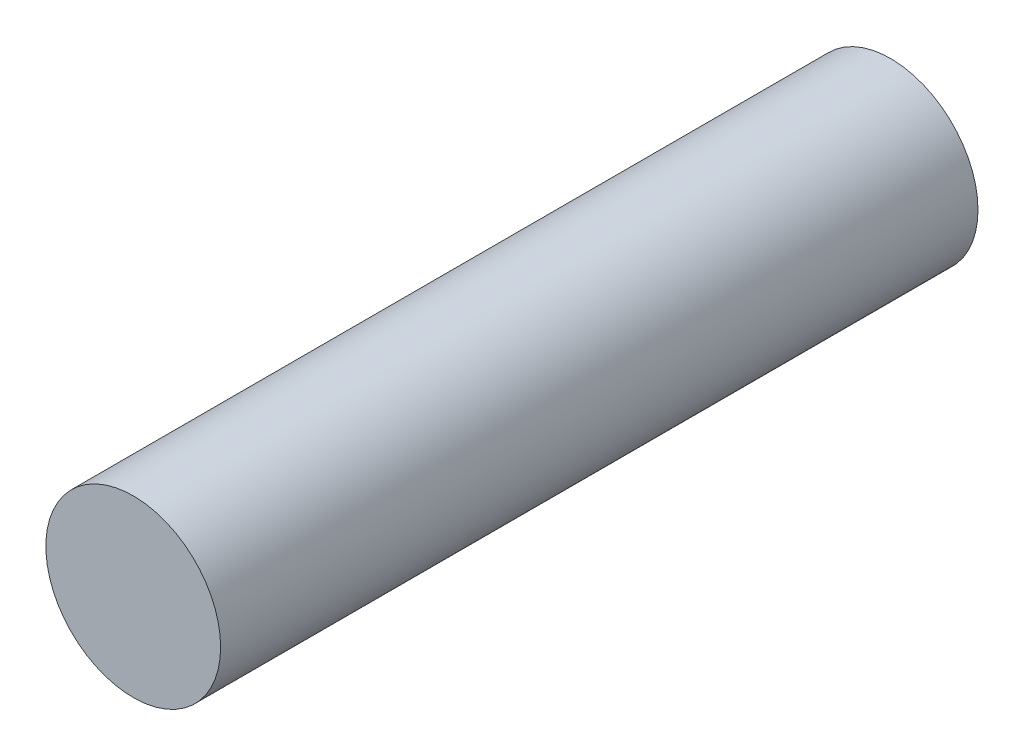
ISO-10303-21;
HEADER;
FILE_DESCRIPTION(('STEP AP214'),'2;1');
FILE_NAME('part.step','',(''),(''),'','','');
FILE_SCHEMA(('AUTOMOTIVE_DESIGN { 1 0 10303 214 1 1 1 1 }'));
ENDSEC;
DATA;
#1=APPLICATION_CONTEXT('core data for automotive mechanical design processes');
#2=APPLICATION_PROTOCOL_DEFINITION('international standard','automotive_design',2000,#1);
#3=PRODUCT_CONTEXT('',#1,'mechanical');
#4=PRODUCT('Part','Part','',(#3));
#5=PRODUCT_RELATED_PRODUCT_CATEGORY('part','',(#4));
#6=PRODUCT_DEFINITION_FORMATION('','',#4);
#7=PRODUCT_DEFINITION_CONTEXT('part definition',#1,'design');
#8=PRODUCT_DEFINITION('design','',#6,#7);
#9=PRODUCT_DEFINITION_SHAPE('','',#8);
#10=(LENGTH_UNIT() NAMED_UNIT(*) SI_UNIT(.MILLI.,.METRE.));
#11=(NAMED_UNIT(*) PLANE_ANGLE_UNIT() SI_UNIT($,.RADIAN.));
#12=(NAMED_UNIT(*) SI_UNIT($,.STERADIAN.) SOLID_ANGLE_UNIT());
#13=UNCERTAINTY_MEASURE_WITH_UNIT(LENGTH_MEASURE(1.E-05),#10,'distance_accuracy_value','');
#14=(GEOMETRIC_REPRESENTATION_CONTEXT(3) GLOBAL_UNCERTAINTY_ASSIGNED_CONTEXT((#13)) GLOBAL_UNIT_ASSIGNED_CONTEXT((#10,
#11,#12)) REPRESENTATION_CONTEXT('',''));
#15=CARTESIAN_POINT('',(0.,0.,0.));
#16=DIRECTION('',(0.,0.,1.));
#17=DIRECTION('',(1.,0.,0.));
#18=AXIS2_PLACEMENT_3D('',#15,#16,#17);
#19=CARTESIAN_POINT('',(0.,0.,5.6134));
#20=DIRECTION('',(0.,0.,-1.));
#21=DIRECTION('',(-1.,0.,0.));
#22=AXIS2_PLACEMENT_3D('',#19,#20,#21);
#23=CYLINDRICAL_SURFACE('',#22,0.6477);
#24=CARTESIAN_POINT('',(0.,0.,5.6134));
#25=DIRECTION('',(0.,0.,1.));
#26=DIRECTION('',(1.,0.,0.));
#27=AXIS2_PLACEMENT_3D('',#24,#25,#26);
#28=CIRCLE('',#27,0.6477);
#29=CARTESIAN_POINT('',(0.6477,0.,5.6134));
#30=VERTEX_POINT('',#29);
#31=EDGE_CURVE('E10',#30,#30,#28,.T.);
#32=ORIENTED_EDGE('',*,*,#31,.F.);
#33=EDGE_LOOP('',(#32));
#34=FACE_BOUND('',#33,.T.);
#35=CARTESIAN_POINT('',(0.,0.,0.));
#36=DIRECTION('',(0.,0.,1.));
#37=DIRECTION('',(1.,0.,0.));
#38=AXIS2_PLACEMENT_3D('',#35,#36,#37);
#39=CIRCLE('',#38,0.6477);
#40=CARTESIAN_POINT('',(0.6477,0.,0.));
#41=VERTEX_POINT('',#40);
#42=EDGE_CURVE('E37',#41,#41,#39,.T.);
#43=ORIENTED_EDGE('',*,*,#42,.T.);
#44=EDGE_LOOP('',(#43));
#45=FACE_BOUND('',#44,.T.);
#46=ADVANCED_FACE('F34',(#34,#45),#23,.T.);
#47=CARTESIAN_POINT('',(0.,0.,5.6134));
#48=DIRECTION('',(0.,0.,1.));
#49=DIRECTION('',(1.,0.,0.));
#50=AXIS2_PLACEMENT_3D('',#47,#48,#49);
#51=PLANE('',#50);
#52=ORIENTED_EDGE('',*,*,#31,.T.);
#53=EDGE_LOOP('',(#52));
#54=FACE_BOUND('',#53,.T.);
#55=ADVANCED_FACE('F50',(#54),#51,.T.);
#56=CARTESIAN_POINT('',(0.,0.,0.));
#57=DIRECTION('',(0.,0.,1.));
#58=DIRECTION('',(1.,0.,0.));
#59=AXIS2_PLACEMENT_3D('',#56,#57,#58);
#60=PLANE('',#59);
#61=ORIENTED_EDGE('',*,*,#42,.F.);
#62=EDGE_LOOP('',(#61));
#63=FACE_BOUND('',#62,.T.);
#64=ADVANCED_FACE('F48',(#63),#60,.F.);
#65=CLOSED_SHELL('',(#46,#55,#64));
#66=MANIFOLD_SOLID_BREP('B2',#65);
#67=ADVANCED_BREP_SHAPE_REPRESENTATION('',(#18,#66),#14);
#68=SHAPE_DEFINITION_REPRESENTATION(#9,#67);
ENDSEC;
END-ISO-10303-21;
